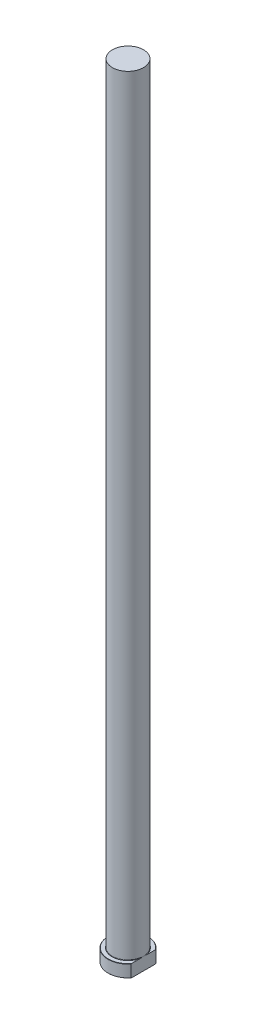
ISO-10303-21;
HEADER;
FILE_DESCRIPTION(('STEP AP214'),'2;1');
FILE_NAME('part.step','',(''),(''),'','','');
FILE_SCHEMA(('AUTOMOTIVE_DESIGN { 1 0 10303 214 1 1 1 1 }'));
ENDSEC;
DATA;
#1=APPLICATION_CONTEXT('core data for automotive mechanical design processes');
#2=APPLICATION_PROTOCOL_DEFINITION('international standard','automotive_design',2000,#1);
#3=PRODUCT_CONTEXT('',#1,'mechanical');
#4=PRODUCT('Part','Part','',(#3));
#5=PRODUCT_RELATED_PRODUCT_CATEGORY('part','',(#4));
#6=PRODUCT_DEFINITION_FORMATION('','',#4);
#7=PRODUCT_DEFINITION_CONTEXT('part definition',#1,'design');
#8=PRODUCT_DEFINITION('design','',#6,#7);
#9=PRODUCT_DEFINITION_SHAPE('','',#8);
#10=(LENGTH_UNIT() NAMED_UNIT(*) SI_UNIT(.MILLI.,.METRE.));
#11=(NAMED_UNIT(*) PLANE_ANGLE_UNIT() SI_UNIT($,.RADIAN.));
#12=(NAMED_UNIT(*) SI_UNIT($,.STERADIAN.) SOLID_ANGLE_UNIT());
#13=UNCERTAINTY_MEASURE_WITH_UNIT(LENGTH_MEASURE(1.E-05),#10,'distance_accuracy_value','');
#14=(GEOMETRIC_REPRESENTATION_CONTEXT(3) GLOBAL_UNCERTAINTY_ASSIGNED_CONTEXT((#13)) GLOBAL_UNIT_ASSIGNED_CONTEXT((#10,
#11,#12)) REPRESENTATION_CONTEXT('',''));
#15=CARTESIAN_POINT('',(0.,0.,0.));
#16=DIRECTION('',(0.,0.,1.));
#17=DIRECTION('',(1.,0.,0.));
#18=AXIS2_PLACEMENT_3D('',#15,#16,#17);
#19=CARTESIAN_POINT('',(0.,0.,0.));
#20=DIRECTION('',(0.,-1.,0.));
#21=DIRECTION('',(0.,0.,-1.));
#22=AXIS2_PLACEMENT_3D('',#19,#20,#21);
#23=PLANE('',#22);
#24=CARTESIAN_POINT('',(0.,0.,0.));
#25=DIRECTION('',(0.,-1.,0.));
#26=DIRECTION('',(0.,0.,-1.));
#27=AXIS2_PLACEMENT_3D('',#24,#25,#26);
#28=CIRCLE('',#27,15.8);
#29=CARTESIAN_POINT('',(12.5,0.,9.66385016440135));
#30=VERTEX_POINT('',#29);
#31=CARTESIAN_POINT('',(12.5,0.,-9.66385016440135));
#32=VERTEX_POINT('',#31);
#33=EDGE_CURVE('E98',#30,#32,#28,.T.);
#34=ORIENTED_EDGE('',*,*,#33,.T.);
#35=DIRECTION('',(0.,0.,1.));
#36=VECTOR('',#35,1.);
#37=CARTESIAN_POINT('',(12.5,0.,-9.98749217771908));
#38=LINE('',#37,#36);
#39=EDGE_CURVE('E83',#32,#30,#38,.T.);
#40=ORIENTED_EDGE('',*,*,#39,.T.);
#41=EDGE_LOOP('',(#34,#40));
#42=FACE_BOUND('',#41,.T.);
#43=ADVANCED_FACE('F32',(#42),#23,.T.);
#44=CARTESIAN_POINT('',(0.,259.958771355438,0.));
#45=DIRECTION('',(0.,1.,0.));
#46=DIRECTION('',(0.,0.,1.));
#47=AXIS2_PLACEMENT_3D('',#44,#45,#46);
#48=CYLINDRICAL_SURFACE('',#47,16.);
#49=CARTESIAN_POINT('',(0.,9.80000000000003,0.));
#50=DIRECTION('',(0.,1.,0.));
#51=DIRECTION('',(0.,0.,1.));
#52=AXIS2_PLACEMENT_3D('',#49,#50,#51);
#53=CIRCLE('',#52,16.);
#54=CARTESIAN_POINT('',(12.5,9.80000000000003,9.98749217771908));
#55=VERTEX_POINT('',#54);
#56=CARTESIAN_POINT('',(12.5,9.80000000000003,-9.98749217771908));
#57=VERTEX_POINT('',#56);
#58=EDGE_CURVE('E104',#55,#57,#53,.F.);
#59=ORIENTED_EDGE('',*,*,#58,.T.);
#60=DIRECTION('',(0.,-1.,0.));
#61=VECTOR('',#60,1.);
#62=CARTESIAN_POINT('',(12.5,630.,-9.98749217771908));
#63=LINE('',#62,#61);
#64=CARTESIAN_POINT('',(12.5,0.199999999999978,-9.98749217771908));
#65=VERTEX_POINT('',#64);
#66=EDGE_CURVE('E183',#57,#65,#63,.T.);
#67=ORIENTED_EDGE('',*,*,#66,.T.);
#68=CARTESIAN_POINT('',(0.,0.199999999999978,0.));
#69=DIRECTION('',(0.,-1.,0.));
#70=DIRECTION('',(0.,0.,-1.));
#71=AXIS2_PLACEMENT_3D('',#68,#69,#70);
#72=CIRCLE('',#71,16.);
#73=CARTESIAN_POINT('',(12.5,0.199999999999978,9.98749217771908));
#74=VERTEX_POINT('',#73);
#75=EDGE_CURVE('E100',#65,#74,#72,.F.);
#76=ORIENTED_EDGE('',*,*,#75,.T.);
#77=DIRECTION('',(0.,-1.,0.));
#78=VECTOR('',#77,1.);
#79=CARTESIAN_POINT('',(12.5,630.,9.98749217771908));
#80=LINE('',#79,#78);
#81=EDGE_CURVE('E93',#55,#74,#80,.T.);
#82=ORIENTED_EDGE('',*,*,#81,.F.);
#83=EDGE_LOOP('',(#59,#67,#76,#82));
#84=FACE_BOUND('',#83,.T.);
#85=ADVANCED_FACE('F158',(#84),#48,.T.);
#86=CARTESIAN_POINT('',(-16.,10.,0.));
#87=DIRECTION('',(0.,1.,0.));
#88=DIRECTION('',(0.,0.,1.));
#89=AXIS2_PLACEMENT_3D('',#86,#87,#88);
#90=PLANE('',#89);
#91=CARTESIAN_POINT('',(0.,10.,0.));
#92=DIRECTION('',(0.,1.,0.));
#93=DIRECTION('',(0.,0.,1.));
#94=AXIS2_PLACEMENT_3D('',#91,#92,#93);
#95=CIRCLE('',#94,15.8);
#96=CARTESIAN_POINT('',(12.5,10.,-9.66385016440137));
#97=VERTEX_POINT('',#96);
#98=CARTESIAN_POINT('',(12.5,10.,9.66385016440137));
#99=VERTEX_POINT('',#98);
#100=EDGE_CURVE('E178',#97,#99,#95,.T.);
#101=ORIENTED_EDGE('',*,*,#100,.T.);
#102=DIRECTION('',(0.,0.,-1.));
#103=VECTOR('',#102,1.);
#104=CARTESIAN_POINT('',(12.5,10.,0.));
#105=LINE('',#104,#103);
#106=CARTESIAN_POINT('',(12.5,10.,2.75499546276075));
#107=VERTEX_POINT('',#106);
#108=EDGE_CURVE('E57',#99,#107,#105,.T.);
#109=ORIENTED_EDGE('',*,*,#108,.T.);
#110=CARTESIAN_POINT('',(0.,10.,0.));
#111=DIRECTION('',(0.,1.,0.));
#112=DIRECTION('',(0.,0.,1.));
#113=AXIS2_PLACEMENT_3D('',#110,#111,#112);
#114=CIRCLE('',#113,12.8);
#115=CARTESIAN_POINT('',(12.5,10.,-2.75499546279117));
#116=VERTEX_POINT('',#115);
#117=EDGE_CURVE('E107',#107,#116,#114,.F.);
#118=ORIENTED_EDGE('',*,*,#117,.T.);
#119=EDGE_CURVE('E136',#116,#97,#105,.T.);
#120=ORIENTED_EDGE('',*,*,#119,.T.);
#121=EDGE_LOOP('',(#101,#109,#118,#120));
#122=FACE_BOUND('',#121,.T.);
#123=ADVANCED_FACE('F147',(#122),#90,.T.);
#124=CARTESIAN_POINT('',(0.,10.,0.));
#125=DIRECTION('',(0.,-1.,0.));
#126=DIRECTION('',(0.,0.,-1.));
#127=AXIS2_PLACEMENT_3D('',#124,#125,#126);
#128=CONICAL_SURFACE('',#127,15.8,0.785398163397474);
#129=ORIENTED_EDGE('',*,*,#58,.F.);
#130=CARTESIAN_POINT('',(12.5,0.520063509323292,21.9732835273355));
#131=CARTESIAN_POINT('',(12.5,0.802025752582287,21.6488770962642));
#132=CARTESIAN_POINT('',(12.5,1.08313217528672,21.3237240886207));
#133=CARTESIAN_POINT('',(12.5,1.64338244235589,20.6717229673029));
#134=CARTESIAN_POINT('',(12.5,1.92252625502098,20.3448748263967));
#135=CARTESIAN_POINT('',(12.5,2.47872061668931,19.689139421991));
#136=CARTESIAN_POINT('',(12.5,2.75577013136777,19.3602512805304));
#137=CARTESIAN_POINT('',(12.5,3.30732757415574,18.7003513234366));
#138=CARTESIAN_POINT('',(12.5,3.58183551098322,18.3693395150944));
#139=CARTESIAN_POINT('',(12.5,4.13404626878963,17.6974852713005));
#140=CARTESIAN_POINT('',(12.5,4.41168315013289,17.3565885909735));
#141=CARTESIAN_POINT('',(12.5,4.96342557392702,16.6719500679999));
#142=CARTESIAN_POINT('',(12.5,5.23753113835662,16.3282082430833));
#143=CARTESIAN_POINT('',(12.5,5.78155974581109,15.6375575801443));
#144=CARTESIAN_POINT('',(12.5,6.05148375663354,15.2906495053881));
#145=CARTESIAN_POINT('',(12.5,6.58649101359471,14.5931154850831));
#146=CARTESIAN_POINT('',(12.5,6.85157426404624,14.2424895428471));
#147=CARTESIAN_POINT('',(12.5,7.37633965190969,13.5365100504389));
#148=CARTESIAN_POINT('',(12.5,7.63601439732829,13.1811509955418));
#149=CARTESIAN_POINT('',(12.5,8.14848411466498,12.4654890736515));
#150=CARTESIAN_POINT('',(12.5,8.4012790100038,12.1051861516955));
#151=CARTESIAN_POINT('',(12.5,8.89877262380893,11.3785626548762));
#152=CARTESIAN_POINT('',(12.5,9.14346420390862,11.0122371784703));
#153=CARTESIAN_POINT('',(12.5,9.62269650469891,10.272992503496));
#154=CARTESIAN_POINT('',(12.5,9.85723744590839,9.90007344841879));
#155=CARTESIAN_POINT('',(12.5,10.3121733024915,9.14938704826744));
#156=CARTESIAN_POINT('',(12.5,10.5326589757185,8.77167495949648));
#157=CARTESIAN_POINT('',(12.5,10.9584323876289,8.00766886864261));
#158=CARTESIAN_POINT('',(12.5,11.1637182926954,7.62137383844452));
#159=CARTESIAN_POINT('',(12.5,11.5550521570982,6.83979556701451));
#160=CARTESIAN_POINT('',(12.5,11.7411279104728,6.44452635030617));
#161=CARTESIAN_POINT('',(12.5,12.0896891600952,5.64379531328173));
#162=CARTESIAN_POINT('',(12.5,12.2521837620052,5.23833749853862));
#163=CARTESIAN_POINT('',(12.5,12.5515074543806,4.40750298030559));
#164=CARTESIAN_POINT('',(12.5,12.6876692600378,3.98188300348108));
#165=CARTESIAN_POINT('',(12.5,12.9230664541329,3.1203601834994));
#166=CARTESIAN_POINT('',(12.5,13.0223077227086,2.68445898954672));
#167=CARTESIAN_POINT('',(12.5,13.1386499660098,2.02637177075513));
#168=CARTESIAN_POINT('',(12.5,13.1719581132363,1.80697979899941));
#169=CARTESIAN_POINT('',(12.5,13.2273896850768,1.36679892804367));
#170=CARTESIAN_POINT('',(12.5,13.2495147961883,1.14601024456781));
#171=CARTESIAN_POINT('',(12.5,13.2821590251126,0.703578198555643));
#172=CARTESIAN_POINT('',(12.5,13.2926782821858,0.481934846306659));
#173=CARTESIAN_POINT('',(12.5,13.3019073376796,0.0383999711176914));
#174=CARTESIAN_POINT('',(12.5,13.3006171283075,-0.183491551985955));
#175=CARTESIAN_POINT('',(12.5,13.2862386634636,-0.627300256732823));
#176=CARTESIAN_POINT('',(12.5,13.2731286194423,-0.849216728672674));
#177=CARTESIAN_POINT('',(12.5,13.2353379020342,-1.29205679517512));
#178=CARTESIAN_POINT('',(12.5,13.2106571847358,-1.51298038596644));
#179=CARTESIAN_POINT('',(12.5,13.1501829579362,-1.9533130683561));
#180=CARTESIAN_POINT('',(12.5,13.1143886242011,-2.17272204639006));
#181=CARTESIAN_POINT('',(12.5,13.0323124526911,-2.60958138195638));
#182=CARTESIAN_POINT('',(12.5,12.9860290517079,-2.82703144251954));
#183=CARTESIAN_POINT('',(12.5,12.8318007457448,-3.47896053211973));
#184=CARTESIAN_POINT('',(12.5,12.7089145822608,-3.90995974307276));
#185=CARTESIAN_POINT('',(12.5,12.4301044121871,-4.76088311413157));
#186=CARTESIAN_POINT('',(12.5,12.2741797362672,-5.18080704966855));
#187=CARTESIAN_POINT('',(12.5,11.899855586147,-6.09704545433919));
#188=CARTESIAN_POINT('',(12.5,11.6752155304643,-6.59079268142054));
#189=CARTESIAN_POINT('',(12.5,11.1959254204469,-7.56361802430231));
#190=CARTESIAN_POINT('',(12.5,10.9412581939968,-8.04268754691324));
#191=CARTESIAN_POINT('',(12.5,10.408564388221,-8.98884891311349));
#192=CARTESIAN_POINT('',(12.5,10.1304909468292,-9.45591416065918));
#193=CARTESIAN_POINT('',(12.5,9.55679554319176,-10.3789360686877));
#194=CARTESIAN_POINT('',(12.5,9.26117703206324,-10.8348948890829));
#195=CARTESIAN_POINT('',(12.5,8.65460060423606,-11.7400212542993));
#196=CARTESIAN_POINT('',(12.5,8.34356847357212,-12.1891388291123));
#197=CARTESIAN_POINT('',(12.5,7.71056360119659,-13.0795913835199));
#198=CARTESIAN_POINT('',(12.5,7.38859046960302,-13.5209260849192));
#199=CARTESIAN_POINT('',(12.5,6.7362707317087,-14.3965599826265));
#200=CARTESIAN_POINT('',(12.5,6.4059341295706,-14.8308666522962));
#201=CARTESIAN_POINT('',(12.5,5.73818513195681,-15.69398428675));
#202=CARTESIAN_POINT('',(12.5,5.40077283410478,-16.1227953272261));
#203=CARTESIAN_POINT('',(12.5,4.69065889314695,-17.0127103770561));
#204=CARTESIAN_POINT('',(12.5,4.31743190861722,-17.473394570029));
#205=CARTESIAN_POINT('',(12.5,3.56536441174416,-18.3901509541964));
#206=CARTESIAN_POINT('',(12.5,3.18652389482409,-18.8462231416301));
#207=CARTESIAN_POINT('',(12.5,2.42850462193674,-19.7493414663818));
#208=CARTESIAN_POINT('',(12.5,2.04937794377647,-20.1964313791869));
#209=CARTESIAN_POINT('',(12.5,1.28737664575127,-21.0872319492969));
#210=CARTESIAN_POINT('',(12.5,0.904502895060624,-21.5309433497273));
#211=CARTESIAN_POINT('',(12.5,0.520063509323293,-21.9732835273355));
#212=B_SPLINE_CURVE_WITH_KNOTS('',3,(#130,#131,#132,#133,#134,#135,#136,#137,#138,#139,#140,
#141,#142,#143,#144,#145,#146,#147,#148,#149,#150,#151,#152,#153,#154,#155,#156,#157,#158,#159,
#160,#161,#162,#163,#164,#165,#166,#167,#168,#169,#170,#171,#172,#173,#174,#175,#176,#177,#178,
#179,#180,#181,#182,#183,#184,#185,#186,#187,#188,#189,#190,#191,#192,#193,#194,#195,#196,#197,
#198,#199,#200,#201,#202,#203,#204,#205,#206,#207,#208,#209,#210,#211),.UNSPECIFIED.,.F.,.F.,(4,
2,2,2,2,2,2,2,2,2,2,2,2,2,2,2,2,2,2,2,2,2,2,2,2,2,2,2,2,2,2,2,2,2,2,2,2,2,2,2,4),(0.,
1.28945110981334,2.57892299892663,3.86899482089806,5.15906221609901,6.47799420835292,
7.79691798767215,9.11553180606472,10.4341444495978,11.7544545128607,13.0747792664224,
14.3962377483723,15.7176675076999,17.0294519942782,18.3413944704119,19.6514113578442,
20.9609210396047,22.3001940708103,23.6392537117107,24.3047314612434,24.9701088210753,
25.6354781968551,26.3008480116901,26.9674468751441,27.6340482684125,28.3006991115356,
28.9674493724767,30.3101828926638,31.6529436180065,33.2788964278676,34.9057836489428,
36.5360093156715,38.1659153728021,39.804623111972,41.4433893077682,43.0802801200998,
44.7171483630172,46.4957886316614,48.2744303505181,50.0329971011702,51.7911651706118),.UNSPECIFIED.);
#213=EDGE_CURVE('E135',#55,#99,#212,.T.);
#214=ORIENTED_EDGE('',*,*,#213,.T.);
#215=ORIENTED_EDGE('',*,*,#100,.F.);
#216=EDGE_CURVE('E127',#97,#57,#212,.T.);
#217=ORIENTED_EDGE('',*,*,#216,.T.);
#218=EDGE_LOOP('',(#129,#214,#215,#217));
#219=FACE_BOUND('',#218,.T.);
#220=ADVANCED_FACE('F143',(#219),#128,.T.);
#221=CARTESIAN_POINT('',(0.,0.199999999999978,0.));
#222=DIRECTION('',(0.,1.,0.));
#223=DIRECTION('',(0.,0.,1.));
#224=AXIS2_PLACEMENT_3D('',#221,#222,#223);
#225=CONICAL_SURFACE('',#224,16.,0.785398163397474);
#226=ORIENTED_EDGE('',*,*,#75,.F.);
#227=CARTESIAN_POINT('',(12.5,9.47993649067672,-21.9732835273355));
#228=CARTESIAN_POINT('',(12.5,9.19797424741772,-21.6488770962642));
#229=CARTESIAN_POINT('',(12.5,8.91686782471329,-21.3237240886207));
#230=CARTESIAN_POINT('',(12.5,8.35661755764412,-20.6717229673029));
#231=CARTESIAN_POINT('',(12.5,8.07747374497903,-20.3448748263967));
#232=CARTESIAN_POINT('',(12.5,7.5212793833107,-19.689139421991));
#233=CARTESIAN_POINT('',(12.5,7.24422986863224,-19.3602512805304));
#234=CARTESIAN_POINT('',(12.5,6.69267242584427,-18.7003513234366));
#235=CARTESIAN_POINT('',(12.5,6.41816448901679,-18.3693395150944));
#236=CARTESIAN_POINT('',(12.5,5.86595373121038,-17.6974852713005));
#237=CARTESIAN_POINT('',(12.5,5.58831684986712,-17.3565885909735));
#238=CARTESIAN_POINT('',(12.5,5.03657442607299,-16.6719500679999));
#239=CARTESIAN_POINT('',(12.5,4.76246886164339,-16.3282082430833));
#240=CARTESIAN_POINT('',(12.5,4.21844025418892,-15.6375575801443));
#241=CARTESIAN_POINT('',(12.5,3.94851624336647,-15.2906495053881));
#242=CARTESIAN_POINT('',(12.5,3.4135089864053,-14.5931154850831));
#243=CARTESIAN_POINT('',(12.5,3.14842573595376,-14.2424895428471));
#244=CARTESIAN_POINT('',(12.5,2.62366034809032,-13.5365100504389));
#245=CARTESIAN_POINT('',(12.5,2.36398560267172,-13.1811509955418));
#246=CARTESIAN_POINT('',(12.5,1.85151588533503,-12.4654890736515));
#247=CARTESIAN_POINT('',(12.5,1.5987209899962,-12.1051861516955));
#248=CARTESIAN_POINT('',(12.5,1.10122737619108,-11.3785626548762));
#249=CARTESIAN_POINT('',(12.5,0.856535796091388,-11.0122371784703));
#250=CARTESIAN_POINT('',(12.5,0.377303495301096,-10.272992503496));
#251=CARTESIAN_POINT('',(12.5,0.14276255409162,-9.90007344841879));
#252=CARTESIAN_POINT('',(12.5,-0.312173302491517,-9.14938704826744));
#253=CARTESIAN_POINT('',(12.5,-0.532658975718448,-8.77167495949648));
#254=CARTESIAN_POINT('',(12.5,-0.958432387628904,-8.00766886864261));
#255=CARTESIAN_POINT('',(12.5,-1.16371829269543,-7.62137383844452));
#256=CARTESIAN_POINT('',(12.5,-1.55505215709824,-6.83979556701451));
#257=CARTESIAN_POINT('',(12.5,-1.74112791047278,-6.44452635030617));
#258=CARTESIAN_POINT('',(12.5,-2.08968916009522,-5.64379531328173));
#259=CARTESIAN_POINT('',(12.5,-2.25218376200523,-5.23833749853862));
#260=CARTESIAN_POINT('',(12.5,-2.55150745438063,-4.40750298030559));
#261=CARTESIAN_POINT('',(12.5,-2.68766926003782,-3.98188300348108));
#262=CARTESIAN_POINT('',(12.5,-2.92306645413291,-3.1203601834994));
#263=CARTESIAN_POINT('',(12.5,-3.02230772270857,-2.68445898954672));
#264=CARTESIAN_POINT('',(12.5,-3.13864996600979,-2.02637177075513));
#265=CARTESIAN_POINT('',(12.5,-3.17195811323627,-1.80697979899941));
#266=CARTESIAN_POINT('',(12.5,-3.22738968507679,-1.36679892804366));
#267=CARTESIAN_POINT('',(12.5,-3.24951479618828,-1.14601024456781));
#268=CARTESIAN_POINT('',(12.5,-3.28215902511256,-0.703578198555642));
#269=CARTESIAN_POINT('',(12.5,-3.29267828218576,-0.481934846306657));
#270=CARTESIAN_POINT('',(12.5,-3.30190733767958,-0.038399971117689));
#271=CARTESIAN_POINT('',(12.5,-3.30061712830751,0.183491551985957));
#272=CARTESIAN_POINT('',(12.5,-3.28623866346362,0.627300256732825));
#273=CARTESIAN_POINT('',(12.5,-3.27312861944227,0.849216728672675));
#274=CARTESIAN_POINT('',(12.5,-3.23533790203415,1.29205679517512));
#275=CARTESIAN_POINT('',(12.5,-3.21065718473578,1.51298038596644));
#276=CARTESIAN_POINT('',(12.5,-3.15018295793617,1.95331306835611));
#277=CARTESIAN_POINT('',(12.5,-3.1143886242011,2.17272204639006));
#278=CARTESIAN_POINT('',(12.5,-3.03231245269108,2.60958138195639));
#279=CARTESIAN_POINT('',(12.5,-2.98602905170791,2.82703144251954));
#280=CARTESIAN_POINT('',(12.5,-2.83180074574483,3.47896053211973));
#281=CARTESIAN_POINT('',(12.5,-2.70891458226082,3.90995974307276));
#282=CARTESIAN_POINT('',(12.5,-2.43010441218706,4.76088311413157));
#283=CARTESIAN_POINT('',(12.5,-2.27417973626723,5.18080704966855));
#284=CARTESIAN_POINT('',(12.5,-1.89985558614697,6.09704545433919));
#285=CARTESIAN_POINT('',(12.5,-1.67521553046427,6.59079268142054));
#286=CARTESIAN_POINT('',(12.5,-1.19592542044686,7.56361802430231));
#287=CARTESIAN_POINT('',(12.5,-0.941258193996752,8.04268754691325));
#288=CARTESIAN_POINT('',(12.5,-0.40856438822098,8.98884891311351));
#289=CARTESIAN_POINT('',(12.5,-0.130490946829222,9.45591416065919));
#290=CARTESIAN_POINT('',(12.5,0.443204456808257,10.3789360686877));
#291=CARTESIAN_POINT('',(12.5,0.738822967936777,10.8348948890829));
#292=CARTESIAN_POINT('',(12.5,1.34539939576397,11.7400212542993));
#293=CARTESIAN_POINT('',(12.5,1.6564315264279,12.1891388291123));
#294=CARTESIAN_POINT('',(12.5,2.28943639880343,13.0795913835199));
#295=CARTESIAN_POINT('',(12.5,2.61140953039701,13.5209260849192));
#296=CARTESIAN_POINT('',(12.5,3.26372926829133,14.3965599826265));
#297=CARTESIAN_POINT('',(12.5,3.59406587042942,14.8308666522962));
#298=CARTESIAN_POINT('',(12.5,4.26181486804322,15.69398428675));
#299=CARTESIAN_POINT('',(12.5,4.59922716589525,16.1227953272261));
#300=CARTESIAN_POINT('',(12.5,5.30934110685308,17.0127103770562));
#301=CARTESIAN_POINT('',(12.5,5.68256809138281,17.473394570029));
#302=CARTESIAN_POINT('',(12.5,6.43463558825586,18.3901509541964));
#303=CARTESIAN_POINT('',(12.5,6.81347610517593,18.8462231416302));
#304=CARTESIAN_POINT('',(12.5,7.57149537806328,19.7493414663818));
#305=CARTESIAN_POINT('',(12.5,7.95062205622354,20.1964313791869));
#306=CARTESIAN_POINT('',(12.5,8.71262335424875,21.0872319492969));
#307=CARTESIAN_POINT('',(12.5,9.09549710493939,21.5309433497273));
#308=CARTESIAN_POINT('',(12.5,9.47993649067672,21.9732835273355));
#309=B_SPLINE_CURVE_WITH_KNOTS('',3,(#227,#228,#229,#230,#231,#232,#233,#234,#235,#236,#237,
#238,#239,#240,#241,#242,#243,#244,#245,#246,#247,#248,#249,#250,#251,#252,#253,#254,#255,#256,
#257,#258,#259,#260,#261,#262,#263,#264,#265,#266,#267,#268,#269,#270,#271,#272,#273,#274,#275,
#276,#277,#278,#279,#280,#281,#282,#283,#284,#285,#286,#287,#288,#289,#290,#291,#292,#293,#294,
#295,#296,#297,#298,#299,#300,#301,#302,#303,#304,#305,#306,#307,#308),.UNSPECIFIED.,.F.,.F.,(4,
2,2,2,2,2,2,2,2,2,2,2,2,2,2,2,2,2,2,2,2,2,2,2,2,2,2,2,2,2,2,2,2,2,2,2,2,2,2,2,4),(0.,
1.28945110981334,2.57892299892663,3.86899482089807,5.15906221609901,6.47799420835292,
7.79691798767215,9.11553180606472,10.4341444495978,11.7544545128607,13.0747792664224,
14.3962377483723,15.7176675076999,17.0294519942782,18.3413944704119,19.6514113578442,
20.9609210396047,22.3001940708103,23.6392537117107,24.3047314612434,24.9701088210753,
25.6354781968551,26.3008480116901,26.9674468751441,27.6340482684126,28.3006991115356,
28.9674493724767,30.3101828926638,31.6529436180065,33.2788964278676,34.9057836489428,
36.5360093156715,38.1659153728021,39.8046231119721,41.4433893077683,43.0802801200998,
44.7171483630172,46.4957886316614,48.2744303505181,50.0329971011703,51.7911651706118),.UNSPECIFIED.);
#310=EDGE_CURVE('E86',#65,#32,#309,.T.);
#311=ORIENTED_EDGE('',*,*,#310,.T.);
#312=ORIENTED_EDGE('',*,*,#33,.F.);
#313=EDGE_CURVE('E89',#30,#74,#309,.T.);
#314=ORIENTED_EDGE('',*,*,#313,.T.);
#315=EDGE_LOOP('',(#226,#311,#312,#314));
#316=FACE_BOUND('',#315,.T.);
#317=ADVANCED_FACE('F97',(#316),#225,.T.);
#318=CARTESIAN_POINT('',(0.,10.3,0.));
#319=DIRECTION('',(0.,1.,0.));
#320=DIRECTION('',(0.,0.,1.));
#321=AXIS2_PLACEMENT_3D('',#318,#319,#320);
#322=TOROIDAL_SURFACE('',#321,12.8,0.3);
#323=CARTESIAN_POINT('',(12.5,10.3,0.));
#324=CARTESIAN_POINT('',(12.5,10.300000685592,-6.08820746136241E-09));
#325=CARTESIAN_POINT('',(12.5,10.300001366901,-5.08876655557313E-07));
#326=CARTESIAN_POINT('',(12.5,10.3000026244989,-1.73661802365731E-06));
#327=CARTESIAN_POINT('',(12.5,10.3000031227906,-2.48490474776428E-06));
#328=CARTESIAN_POINT('',(12.5,10.3000042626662,-4.35291163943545E-06));
#329=CARTESIAN_POINT('',(12.5,10.3000048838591,-5.50325566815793E-06));
#330=CARTESIAN_POINT('',(12.5,10.3000058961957,-7.76527023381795E-06));
#331=CARTESIAN_POINT('',(12.5,10.3000063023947,-8.87193032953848E-06));
#332=CARTESIAN_POINT('',(12.5,10.3000080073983,-1.35535117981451E-05));
#333=CARTESIAN_POINT('',(12.5,10.300009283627,-1.71478698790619E-05));
#334=CARTESIAN_POINT('',(12.5,10.3000111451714,-2.39305737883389E-05));
#335=CARTESIAN_POINT('',(12.5,10.30001180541,-2.70989461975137E-05));
#336=CARTESIAN_POINT('',(12.5,10.3000165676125,-5.05411717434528E-05));
#337=CARTESIAN_POINT('',(12.5,10.3000200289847,-7.09185071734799E-05));
#338=CARTESIAN_POINT('',(12.5,10.300032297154,-0.000151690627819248));
#339=CARTESIAN_POINT('',(12.5,10.3000383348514,-0.000212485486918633));
#340=CARTESIAN_POINT('',(12.5,10.3000659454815,-0.000448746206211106));
#341=CARTESIAN_POINT('',(12.5,10.3000952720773,-0.000623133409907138));
#342=CARTESIAN_POINT('',(12.5,10.3002039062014,-0.00128772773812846));
#343=CARTESIAN_POINT('',(12.5,10.3002776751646,-0.00177866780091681));
#344=CARTESIAN_POINT('',(12.5,10.3005641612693,-0.00366503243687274));
#345=CARTESIAN_POINT('',(12.5,10.3007823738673,-0.00505974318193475));
#346=CARTESIAN_POINT('',(12.5,10.3018133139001,-0.0116680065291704));
#347=CARTESIAN_POINT('',(12.5,10.3026180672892,-0.0168825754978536));
#348=CARTESIAN_POINT('',(12.5,10.3120514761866,-0.0779781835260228));
#349=CARTESIAN_POINT('',(12.5,10.3207244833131,-0.133853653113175));
#350=CARTESIAN_POINT('',(12.5,10.3388658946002,-0.251282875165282));
#351=CARTESIAN_POINT('',(12.5,10.3483257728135,-0.312837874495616));
#352=CARTESIAN_POINT('',(12.5,10.3639287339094,-0.415046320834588));
#353=CARTESIAN_POINT('',(12.5,10.3701065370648,-0.455694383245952));
#354=CARTESIAN_POINT('',(12.5,10.3822268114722,-0.53596333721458));
#355=CARTESIAN_POINT('',(12.5,10.3881712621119,-0.57558393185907));
#356=CARTESIAN_POINT('',(12.5,10.4217048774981,-0.800849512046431));
#357=CARTESIAN_POINT('',(12.5,10.4483430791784,-0.986638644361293));
#358=CARTESIAN_POINT('',(12.5,10.4978676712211,-1.36073085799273));
#359=CARTESIAN_POINT('',(12.5,10.5207116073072,-1.54903981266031));
#360=CARTESIAN_POINT('',(12.5,10.5510813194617,-1.84372746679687));
#361=CARTESIAN_POINT('',(12.5,10.5609338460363,-1.94986334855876));
#362=CARTESIAN_POINT('',(12.5,10.5778401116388,-2.16235517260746));
#363=CARTESIAN_POINT('',(12.5,10.5848941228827,-2.26871109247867));
#364=CARTESIAN_POINT('',(12.5,10.5953321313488,-2.48120575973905));
#365=CARTESIAN_POINT('',(12.5,10.5987299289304,-2.58734380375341));
#366=CARTESIAN_POINT('',(12.5,10.6006981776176,-2.79965289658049));
#367=CARTESIAN_POINT('',(12.5,10.5992708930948,-2.90582390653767));
#368=CARTESIAN_POINT('',(12.5,10.5920660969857,-3.06242328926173));
#369=CARTESIAN_POINT('',(12.5,10.5889531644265,-3.11297361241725));
#370=CARTESIAN_POINT('',(12.5,10.5807735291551,-3.21396863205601));
#371=CARTESIAN_POINT('',(12.5,10.5757051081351,-3.26441319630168));
#372=CARTESIAN_POINT('',(12.5,10.5631618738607,-3.36425835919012));
#373=CARTESIAN_POINT('',(12.5,10.555723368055,-3.41366343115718));
#374=CARTESIAN_POINT('',(12.5,10.5375916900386,-3.51185380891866));
#375=CARTESIAN_POINT('',(12.5,10.5269024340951,-3.56063978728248));
#376=CARTESIAN_POINT('',(12.5,10.5054348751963,-3.6391830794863));
#377=CARTESIAN_POINT('',(12.5,10.4961365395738,-3.66933696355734));
#378=CARTESIAN_POINT('',(12.5,10.474763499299,-3.72862196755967));
#379=CARTESIAN_POINT('',(12.5,10.462694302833,-3.75775498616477));
#380=CARTESIAN_POINT('',(12.5,10.4380385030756,-3.80618627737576));
#381=CARTESIAN_POINT('',(12.5,10.4265070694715,-3.8259857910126));
#382=CARTESIAN_POINT('',(12.5,10.4063926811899,-3.85382979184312));
#383=CARTESIAN_POINT('',(12.5,10.3991733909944,-3.8628437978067));
#384=CARTESIAN_POINT('',(12.5,10.3835233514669,-3.87975615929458));
#385=CARTESIAN_POINT('',(12.5,10.3750969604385,-3.88765833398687));
#386=CARTESIAN_POINT('',(12.5,10.3611065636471,-3.89824999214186));
#387=CARTESIAN_POINT('',(12.5,10.3560749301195,-3.9016366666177));
#388=CARTESIAN_POINT('',(12.5,10.3455861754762,-3.90768435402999));
#389=CARTESIAN_POINT('',(12.5,10.3401292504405,-3.91034569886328));
#390=CARTESIAN_POINT('',(12.5,10.3287657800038,-3.91474619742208));
#391=CARTESIAN_POINT('',(12.5,10.3228544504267,-3.91647335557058));
#392=CARTESIAN_POINT('',(12.5,10.3108092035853,-3.91873417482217));
#393=CARTESIAN_POINT('',(12.5,10.3046756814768,-3.91926985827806));
#394=CARTESIAN_POINT('',(12.5,10.293185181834,-3.91908606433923));
#395=CARTESIAN_POINT('',(12.5,10.2878253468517,-3.91851265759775));
#396=CARTESIAN_POINT('',(12.5,10.2772818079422,-3.91645967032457));
#397=CARTESIAN_POINT('',(12.5,10.2720982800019,-3.91497921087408));
#398=CARTESIAN_POINT('',(12.5,10.2604757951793,-3.91068184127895));
#399=CARTESIAN_POINT('',(12.5,10.2541380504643,-3.90759459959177));
#400=CARTESIAN_POINT('',(12.5,10.2420308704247,-3.90046137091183));
#401=CARTESIAN_POINT('',(12.5,10.2362627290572,-3.89641326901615));
#402=CARTESIAN_POINT('',(12.5,10.2213149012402,-3.88449159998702));
#403=CARTESIAN_POINT('',(12.5,10.2126659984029,-3.87596096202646));
#404=CARTESIAN_POINT('',(12.5,10.1966439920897,-3.85778795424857));
#405=CARTESIAN_POINT('',(12.5,10.1892747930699,-3.84814232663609));
#406=CARTESIAN_POINT('',(12.5,10.1725709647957,-3.82389784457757));
#407=CARTESIAN_POINT('',(12.5,10.1637497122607,-3.80894948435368));
#408=CARTESIAN_POINT('',(12.5,10.1475318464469,-3.77828784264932));
#409=CARTESIAN_POINT('',(12.5,10.1401383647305,-3.76257297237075));
#410=CARTESIAN_POINT('',(12.5,10.1264047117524,-3.73059893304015));
#411=CARTESIAN_POINT('',(12.5,10.1200701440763,-3.71433738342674));
#412=CARTESIAN_POINT('',(12.5,10.1082745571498,-3.68152468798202));
#413=CARTESIAN_POINT('',(12.5,10.1028126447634,-3.66497385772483));
#414=CARTESIAN_POINT('',(12.5,10.0886990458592,-3.61898372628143));
#415=CARTESIAN_POINT('',(12.5,10.0807822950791,-3.58931942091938));
#416=CARTESIAN_POINT('',(12.5,10.0665587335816,-3.52960268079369));
#417=CARTESIAN_POINT('',(12.5,10.0602528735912,-3.49955002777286));
#418=CARTESIAN_POINT('',(12.5,10.0432020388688,-3.40892020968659));
#419=CARTESIAN_POINT('',(12.5,10.0343558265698,-3.34798718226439));
#420=CARTESIAN_POINT('',(12.5,10.0201228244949,-3.22565891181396));
#421=CARTESIAN_POINT('',(12.5,10.0147414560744,-3.16426309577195));
#422=CARTESIAN_POINT('',(12.5,10.0066240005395,-3.04138251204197));
#423=CARTESIAN_POINT('',(12.5,10.0038844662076,-2.97989796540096));
#424=CARTESIAN_POINT('',(12.5,10.0005131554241,-2.8577235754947));
#425=CARTESIAN_POINT('',(12.5,9.99985290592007,-2.79703443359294));
#426=CARTESIAN_POINT('',(12.5,10.0002004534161,-2.67565900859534));
#427=CARTESIAN_POINT('',(12.5,10.0012083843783,-2.61497272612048));
#428=CARTESIAN_POINT('',(12.5,10.0063170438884,-2.43292800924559));
#429=CARTESIAN_POINT('',(12.5,10.0125034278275,-2.31162822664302));
#430=CARTESIAN_POINT('',(12.5,10.028923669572,-2.06913309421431));
#431=CARTESIAN_POINT('',(12.5,10.0391638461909,-1.94793820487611));
#432=CARTESIAN_POINT('',(12.5,10.0626694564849,-1.70583328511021));
#433=CARTESIAN_POINT('',(12.5,10.0759352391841,-1.58492328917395));
#434=CARTESIAN_POINT('',(12.5,10.1189883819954,-1.22310927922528));
#435=CARTESIAN_POINT('',(12.5,10.1520738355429,-0.982605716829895));
#436=CARTESIAN_POINT('',(12.5,10.2222679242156,-0.502161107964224));
#437=CARTESIAN_POINT('',(12.5,10.2593775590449,-0.262220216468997));
#438=CARTESIAN_POINT('',(12.5,10.2965571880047,-0.0222236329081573));
#439=CARTESIAN_POINT('',(12.5,10.2965669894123,-0.0221603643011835));
#440=CARTESIAN_POINT('',(12.5,10.2972687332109,-0.017630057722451));
#441=CARTESIAN_POINT('',(12.5,10.2979552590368,-0.0131622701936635));
#442=CARTESIAN_POINT('',(12.5,10.2989608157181,-0.00672404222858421));
#443=CARTESIAN_POINT('',(12.5,10.2992709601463,-0.00475237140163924));
#444=CARTESIAN_POINT('',(12.5,10.299665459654,-0.00214447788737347));
#445=CARTESIAN_POINT('',(12.5,10.299760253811,-0.0015097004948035));
#446=CARTESIAN_POINT('',(12.5,10.2998957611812,-0.000678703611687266));
#447=CARTESIAN_POINT('',(12.5,10.2999287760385,-0.000481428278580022));
#448=CARTESIAN_POINT('',(12.5,10.2999592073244,-0.000219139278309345));
#449=CARTESIAN_POINT('',(12.5,10.2999655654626,-0.000155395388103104));
#450=CARTESIAN_POINT('',(12.5,10.2999789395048,-7.14631131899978E-05));
#451=CARTESIAN_POINT('',(12.5,10.2999826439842,-5.07827878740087E-05));
#452=CARTESIAN_POINT('',(12.5,10.2999877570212,-2.70484026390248E-05));
#453=CARTESIAN_POINT('',(12.5,10.2999884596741,-2.3870209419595E-05));
#454=CARTESIAN_POINT('',(12.5,10.2999904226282,-1.70721258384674E-05));
#455=CARTESIAN_POINT('',(12.5,10.2999917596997,-1.34738016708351E-05));
#456=CARTESIAN_POINT('',(12.5,10.2999935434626,-8.79208554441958E-06));
#457=CARTESIAN_POINT('',(12.5,10.2999939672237,-7.68838220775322E-06));
#458=CARTESIAN_POINT('',(12.5,10.2999950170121,-5.43535458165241E-06));
#459=CARTESIAN_POINT('',(12.5,10.2999956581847,-4.29133306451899E-06));
#460=CARTESIAN_POINT('',(12.5,10.2999968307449,-2.43685216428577E-06));
#461=CARTESIAN_POINT('',(12.5,10.29999734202,-1.69517537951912E-06));
#462=CARTESIAN_POINT('',(12.5,10.2999986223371,-4.8608665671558E-07));
#463=CARTESIAN_POINT('',(12.5,10.2999993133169,6.09789656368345E-09));
#464=CARTESIAN_POINT('',(12.5,10.3,0.));
#465=B_SPLINE_CURVE_WITH_KNOTS('',3,(#323,#324,#325,#326,#327,#328,#329,#330,#331,#332,#333,
#334,#335,#336,#337,#338,#339,#340,#341,#342,#343,#344,#345,#346,#347,#348,#349,#350,#351,#352,
#353,#354,#355,#356,#357,#358,#359,#360,#361,#362,#363,#364,#365,#366,#367,#368,#369,#370,#371,
#372,#373,#374,#375,#376,#377,#378,#379,#380,#381,#382,#383,#384,#385,#386,#387,#388,#389,#390,
#391,#392,#393,#394,#395,#396,#397,#398,#399,#400,#401,#402,#403,#404,#405,#406,#407,#408,#409,
#410,#411,#412,#413,#414,#415,#416,#417,#418,#419,#420,#421,#422,#423,#424,#425,#426,#427,#428,
#429,#430,#431,#432,#433,#434,#435,#436,#437,#438,#439,#440,#441,#442,#443,#444,#445,#446,#447,
#448,#449,#450,#451,#452,#453,#454,#455,#456,#457,#458,#459,#460,#461,#462,#463,#464),
.UNSPECIFIED.,.T.,.F.,(4,2,2,2,2,2,2,2,2,2,2,2,2,2,2,2,2,2,2,2,2,2,2,2,2,2,2,2,2,2,2,2,2,2,2,2,
2,2,2,2,2,2,2,2,2,2,2,2,2,2,2,2,2,2,2,2,2,2,2,2,2,2,2,2,2,2,2,2,2,2,4),(0.,2.18904227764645E-06,
4.96900724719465E-06,8.83863216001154E-06,1.23796733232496E-05,2.37905621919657E-05,
3.34897803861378E-05,9.54946146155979E-05,0.000278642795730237,0.000808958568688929,
0.00229845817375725,0.00653331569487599,0.0223624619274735,0.191994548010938,0.378827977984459,
0.502172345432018,0.622364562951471,1.1854146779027,1.75439293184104,2.07414276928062,
2.39386149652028,2.71236916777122,3.0307273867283,3.18263838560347,3.33468317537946,
3.48450253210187,3.63414210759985,3.72872153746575,3.82311455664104,3.89154751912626,
3.92612498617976,3.96058061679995,3.97873163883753,3.9968743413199,4.01524478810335,
4.03358402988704,4.04967096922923,4.06577352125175,4.08680352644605,4.10788025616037,
4.14411883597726,4.18046611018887,4.23240896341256,4.28446448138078,4.3367872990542,
4.389056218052,4.48109408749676,4.57318615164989,4.75772997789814,4.94256185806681,
5.12715223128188,5.30920363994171,5.4912696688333,5.85553516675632,6.22037071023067,
6.58524836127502,7.31345308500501,8.04183912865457,8.04203119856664,8.05559213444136,
8.06157963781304,8.0635052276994,8.06410510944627,8.06429712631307,8.06436014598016,
8.06436990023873,8.06438138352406,8.06438493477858,8.06438881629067,8.06439160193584,
8.06439379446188),.UNSPECIFIED.);
#466=CARTESIAN_POINT('',(12.5,10.3,0.));
#467=VERTEX_POINT('',#466);
#468=EDGE_CURVE('E11',#116,#467,#465,.T.);
#469=ORIENTED_EDGE('',*,*,#468,.F.);
#470=ORIENTED_EDGE('',*,*,#117,.F.);
#471=CARTESIAN_POINT('',(12.5,10.3,0.));
#472=CARTESIAN_POINT('',(12.5,10.299999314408,6.08820735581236E-09));
#473=CARTESIAN_POINT('',(12.5,10.299998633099,5.08876655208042E-07));
#474=CARTESIAN_POINT('',(12.5,10.2999973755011,1.73661802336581E-06));
#475=CARTESIAN_POINT('',(12.5,10.2999968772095,2.48490474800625E-06));
#476=CARTESIAN_POINT('',(12.5,10.2999957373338,4.35291163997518E-06));
#477=CARTESIAN_POINT('',(12.5,10.2999951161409,5.50325566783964E-06));
#478=CARTESIAN_POINT('',(12.5,10.2999941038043,7.76527023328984E-06));
#479=CARTESIAN_POINT('',(12.5,10.2999936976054,8.87193032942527E-06));
#480=CARTESIAN_POINT('',(12.5,10.2999919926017,1.35535117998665E-05));
#481=CARTESIAN_POINT('',(12.5,10.2999907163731,1.71478698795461E-05));
#482=CARTESIAN_POINT('',(12.5,10.2999888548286,2.39305737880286E-05));
#483=CARTESIAN_POINT('',(12.5,10.29998819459,2.70989461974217E-05));
#484=CARTESIAN_POINT('',(12.5,10.2999834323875,5.05411717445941E-05));
#485=CARTESIAN_POINT('',(12.5,10.2999799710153,7.09185071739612E-05));
#486=CARTESIAN_POINT('',(12.5,10.299967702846,0.000151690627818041));
#487=CARTESIAN_POINT('',(12.5,10.2999616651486,0.000212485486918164));
#488=CARTESIAN_POINT('',(12.5,10.2999340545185,0.000448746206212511));
#489=CARTESIAN_POINT('',(12.5,10.2999047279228,0.000623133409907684));
#490=CARTESIAN_POINT('',(12.5,10.2997960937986,0.00128772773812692));
#491=CARTESIAN_POINT('',(12.5,10.2997223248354,0.00177866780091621));
#492=CARTESIAN_POINT('',(12.5,10.2994358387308,0.00366503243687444));
#493=CARTESIAN_POINT('',(12.5,10.2992176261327,0.00505974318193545));
#494=CARTESIAN_POINT('',(12.5,10.2981866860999,0.0116680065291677));
#495=CARTESIAN_POINT('',(12.5,10.2973819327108,0.0168825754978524));
#496=CARTESIAN_POINT('',(12.5,10.2879485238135,0.0779781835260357));
#497=CARTESIAN_POINT('',(12.5,10.2792755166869,0.133853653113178));
#498=CARTESIAN_POINT('',(12.5,10.2611341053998,0.251282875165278));
#499=CARTESIAN_POINT('',(12.5,10.2516742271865,0.312837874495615));
#500=CARTESIAN_POINT('',(12.5,10.2360712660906,0.415046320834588));
#501=CARTESIAN_POINT('',(12.5,10.2298934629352,0.455694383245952));
#502=CARTESIAN_POINT('',(12.5,10.2177731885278,0.53596333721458));
#503=CARTESIAN_POINT('',(12.5,10.2118287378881,0.57558393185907));
#504=CARTESIAN_POINT('',(12.5,10.1782951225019,0.800849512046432));
#505=CARTESIAN_POINT('',(12.5,10.1516569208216,0.986638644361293));
#506=CARTESIAN_POINT('',(12.5,10.1021323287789,1.36073085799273));
#507=CARTESIAN_POINT('',(12.5,10.0792883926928,1.54903981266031));
#508=CARTESIAN_POINT('',(12.5,10.0489186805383,1.84372746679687));
#509=CARTESIAN_POINT('',(12.5,10.0390661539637,1.94986334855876));
#510=CARTESIAN_POINT('',(12.5,10.0221598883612,2.16235517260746));
#511=CARTESIAN_POINT('',(12.5,10.0151058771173,2.26871109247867));
#512=CARTESIAN_POINT('',(12.5,10.0046678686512,2.48120575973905));
#513=CARTESIAN_POINT('',(12.5,10.0012700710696,2.58734380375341));
#514=CARTESIAN_POINT('',(12.5,9.99930182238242,2.79965289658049));
#515=CARTESIAN_POINT('',(12.5,10.0007291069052,2.90582390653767));
#516=CARTESIAN_POINT('',(12.5,10.0079339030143,3.06242328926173));
#517=CARTESIAN_POINT('',(12.5,10.0110468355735,3.11297361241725));
#518=CARTESIAN_POINT('',(12.5,10.0192264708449,3.21396863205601));
#519=CARTESIAN_POINT('',(12.5,10.0242948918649,3.26441319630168));
#520=CARTESIAN_POINT('',(12.5,10.0368381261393,3.36425835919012));
#521=CARTESIAN_POINT('',(12.5,10.044276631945,3.41366343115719));
#522=CARTESIAN_POINT('',(12.5,10.0624083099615,3.51185380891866));
#523=CARTESIAN_POINT('',(12.5,10.0730975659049,3.56063978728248));
#524=CARTESIAN_POINT('',(12.5,10.0945651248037,3.6391830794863));
#525=CARTESIAN_POINT('',(12.5,10.1038634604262,3.66933696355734));
#526=CARTESIAN_POINT('',(12.5,10.125236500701,3.72862196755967));
#527=CARTESIAN_POINT('',(12.5,10.137305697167,3.75775498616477));
#528=CARTESIAN_POINT('',(12.5,10.1619614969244,3.80618627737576));
#529=CARTESIAN_POINT('',(12.5,10.1734929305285,3.8259857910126));
#530=CARTESIAN_POINT('',(12.5,10.1936073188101,3.85382979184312));
#531=CARTESIAN_POINT('',(12.5,10.2008266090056,3.8628437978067));
#532=CARTESIAN_POINT('',(12.5,10.2164766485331,3.87975615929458));
#533=CARTESIAN_POINT('',(12.5,10.2249030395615,3.88765833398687));
#534=CARTESIAN_POINT('',(12.5,10.2388934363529,3.89824999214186));
#535=CARTESIAN_POINT('',(12.5,10.2439250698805,3.9016366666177));
#536=CARTESIAN_POINT('',(12.5,10.2544138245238,3.90768435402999));
#537=CARTESIAN_POINT('',(12.5,10.2598707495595,3.91034569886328));
#538=CARTESIAN_POINT('',(12.5,10.2712342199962,3.91474619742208));
#539=CARTESIAN_POINT('',(12.5,10.2771455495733,3.91647335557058));
#540=CARTESIAN_POINT('',(12.5,10.2891907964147,3.91873417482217));
#541=CARTESIAN_POINT('',(12.5,10.2953243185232,3.91926985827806));
#542=CARTESIAN_POINT('',(12.5,10.306814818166,3.91908606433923));
#543=CARTESIAN_POINT('',(12.5,10.3121746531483,3.91851265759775));
#544=CARTESIAN_POINT('',(12.5,10.3227181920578,3.91645967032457));
#545=CARTESIAN_POINT('',(12.5,10.3279017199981,3.91497921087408));
#546=CARTESIAN_POINT('',(12.5,10.3395242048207,3.91068184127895));
#547=CARTESIAN_POINT('',(12.5,10.3458619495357,3.90759459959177));
#548=CARTESIAN_POINT('',(12.5,10.3579691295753,3.90046137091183));
#549=CARTESIAN_POINT('',(12.5,10.3637372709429,3.89641326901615));
#550=CARTESIAN_POINT('',(12.5,10.3786850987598,3.88449159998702));
#551=CARTESIAN_POINT('',(12.5,10.3873340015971,3.87596096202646));
#552=CARTESIAN_POINT('',(12.5,10.4033560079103,3.85778795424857));
#553=CARTESIAN_POINT('',(12.5,10.4107252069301,3.84814232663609));
#554=CARTESIAN_POINT('',(12.5,10.4274290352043,3.82389784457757));
#555=CARTESIAN_POINT('',(12.5,10.4362502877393,3.80894948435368));
#556=CARTESIAN_POINT('',(12.5,10.4524681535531,3.77828784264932));
#557=CARTESIAN_POINT('',(12.5,10.4598616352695,3.76257297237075));
#558=CARTESIAN_POINT('',(12.5,10.4735952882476,3.73059893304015));
#559=CARTESIAN_POINT('',(12.5,10.4799298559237,3.71433738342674));
#560=CARTESIAN_POINT('',(12.5,10.4917254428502,3.68152468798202));
#561=CARTESIAN_POINT('',(12.5,10.4971873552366,3.66497385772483));
#562=CARTESIAN_POINT('',(12.5,10.5113009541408,3.61898372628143));
#563=CARTESIAN_POINT('',(12.5,10.5192177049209,3.58931942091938));
#564=CARTESIAN_POINT('',(12.5,10.5334412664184,3.52960268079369));
#565=CARTESIAN_POINT('',(12.5,10.5397471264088,3.49955002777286));
#566=CARTESIAN_POINT('',(12.5,10.5567979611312,3.40892020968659));
#567=CARTESIAN_POINT('',(12.5,10.5656441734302,3.34798718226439));
#568=CARTESIAN_POINT('',(12.5,10.5798771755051,3.22565891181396));
#569=CARTESIAN_POINT('',(12.5,10.5852585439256,3.16426309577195));
#570=CARTESIAN_POINT('',(12.5,10.5933759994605,3.04138251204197));
#571=CARTESIAN_POINT('',(12.5,10.5961155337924,2.97989796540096));
#572=CARTESIAN_POINT('',(12.5,10.5994868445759,2.8577235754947));
#573=CARTESIAN_POINT('',(12.5,10.6001470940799,2.79703443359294));
#574=CARTESIAN_POINT('',(12.5,10.5997995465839,2.67565900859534));
#575=CARTESIAN_POINT('',(12.5,10.5987916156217,2.61497272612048));
#576=CARTESIAN_POINT('',(12.5,10.5936829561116,2.43292800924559));
#577=CARTESIAN_POINT('',(12.5,10.5874965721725,2.31162822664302));
#578=CARTESIAN_POINT('',(12.5,10.571076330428,2.06913309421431));
#579=CARTESIAN_POINT('',(12.5,10.5608361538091,1.94793820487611));
#580=CARTESIAN_POINT('',(12.5,10.5373305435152,1.70583328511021));
#581=CARTESIAN_POINT('',(12.5,10.5240647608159,1.58492328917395));
#582=CARTESIAN_POINT('',(12.5,10.4810116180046,1.22310927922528));
#583=CARTESIAN_POINT('',(12.5,10.4479261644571,0.982605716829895));
#584=CARTESIAN_POINT('',(12.5,10.3777320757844,0.502161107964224));
#585=CARTESIAN_POINT('',(12.5,10.3406224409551,0.262220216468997));
#586=CARTESIAN_POINT('',(12.5,10.3034428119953,0.0222236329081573));
#587=CARTESIAN_POINT('',(12.5,10.3034330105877,0.0221603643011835));
#588=CARTESIAN_POINT('',(12.5,10.3027312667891,0.017630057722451));
#589=CARTESIAN_POINT('',(12.5,10.3020447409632,0.0131622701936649));
#590=CARTESIAN_POINT('',(12.5,10.3010391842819,0.00672404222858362));
#591=CARTESIAN_POINT('',(12.5,10.3007290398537,0.00475237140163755));
#592=CARTESIAN_POINT('',(12.5,10.300334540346,0.00214447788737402));
#593=CARTESIAN_POINT('',(12.5,10.300239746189,0.00150970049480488));
#594=CARTESIAN_POINT('',(12.5,10.3001042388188,0.000678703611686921));
#595=CARTESIAN_POINT('',(12.5,10.3000712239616,0.000481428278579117));
#596=CARTESIAN_POINT('',(12.5,10.3000407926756,0.000219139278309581));
#597=CARTESIAN_POINT('',(12.5,10.3000344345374,0.000155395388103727));
#598=CARTESIAN_POINT('',(12.5,10.3000210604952,7.1463113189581E-05));
#599=CARTESIAN_POINT('',(12.5,10.3000173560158,5.07827878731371E-05));
#600=CARTESIAN_POINT('',(12.5,10.3000122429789,2.70484026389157E-05));
#601=CARTESIAN_POINT('',(12.5,10.300011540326,2.38702094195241E-05));
#602=CARTESIAN_POINT('',(12.5,10.3000095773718,1.70721258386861E-05));
#603=CARTESIAN_POINT('',(12.5,10.3000082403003,1.3473801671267E-05));
#604=CARTESIAN_POINT('',(12.5,10.3000064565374,8.79208554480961E-06));
#605=CARTESIAN_POINT('',(12.5,10.3000060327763,7.68838220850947E-06));
#606=CARTESIAN_POINT('',(12.5,10.3000049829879,5.43535458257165E-06));
#607=CARTESIAN_POINT('',(12.5,10.3000043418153,4.29133306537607E-06));
#608=CARTESIAN_POINT('',(12.5,10.3000031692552,2.43685216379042E-06));
#609=CARTESIAN_POINT('',(12.5,10.30000265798,1.69517537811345E-06));
#610=CARTESIAN_POINT('',(12.5,10.3000013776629,4.86086655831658E-07));
#611=CARTESIAN_POINT('',(12.5,10.3000006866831,-6.09789645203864E-09));
#612=CARTESIAN_POINT('',(12.5,10.3,0.));
#613=B_SPLINE_CURVE_WITH_KNOTS('',3,(#471,#472,#473,#474,#475,#476,#477,#478,#479,#480,#481,
#482,#483,#484,#485,#486,#487,#488,#489,#490,#491,#492,#493,#494,#495,#496,#497,#498,#499,#500,
#501,#502,#503,#504,#505,#506,#507,#508,#509,#510,#511,#512,#513,#514,#515,#516,#517,#518,#519,
#520,#521,#522,#523,#524,#525,#526,#527,#528,#529,#530,#531,#532,#533,#534,#535,#536,#537,#538,
#539,#540,#541,#542,#543,#544,#545,#546,#547,#548,#549,#550,#551,#552,#553,#554,#555,#556,#557,
#558,#559,#560,#561,#562,#563,#564,#565,#566,#567,#568,#569,#570,#571,#572,#573,#574,#575,#576,
#577,#578,#579,#580,#581,#582,#583,#584,#585,#586,#587,#588,#589,#590,#591,#592,#593,#594,#595,
#596,#597,#598,#599,#600,#601,#602,#603,#604,#605,#606,#607,#608,#609,#610,#611,#612),
.UNSPECIFIED.,.T.,.F.,(4,2,2,2,2,2,2,2,2,2,2,2,2,2,2,2,2,2,2,2,2,2,2,2,2,2,2,2,2,2,2,2,2,2,2,2,
2,2,2,2,2,2,2,2,2,2,2,2,2,2,2,2,2,2,2,2,2,2,2,2,2,2,2,2,2,2,2,2,2,2,4),(0.,2.18904227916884E-06,
4.96900724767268E-06,8.83863216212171E-06,1.23796733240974E-05,2.37905621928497E-05,
3.34897803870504E-05,9.54946146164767E-05,0.000278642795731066,0.000808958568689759,
0.00229845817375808,0.00653331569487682,0.0223624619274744,0.191994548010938,0.37882797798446,
0.502172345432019,0.622364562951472,1.1854146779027,1.75439293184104,2.07414276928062,
2.39386149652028,2.71236916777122,3.0307273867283,3.18263838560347,3.33468317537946,
3.48450253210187,3.63414210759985,3.72872153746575,3.82311455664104,3.89154751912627,
3.92612498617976,3.96058061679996,3.97873163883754,3.9968743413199,4.01524478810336,
4.03358402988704,4.04967096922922,4.06577352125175,4.08680352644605,4.10788025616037,
4.14411883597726,4.18046611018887,4.23240896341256,4.28446448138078,4.3367872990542,
4.389056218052,4.48109408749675,4.57318615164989,4.75772997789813,4.9425618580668,
5.12715223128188,5.30920363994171,5.4912696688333,5.85553516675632,6.22037071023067,
6.58524836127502,7.31345308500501,8.04183912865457,8.04203119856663,8.05559213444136,
8.06157963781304,8.06350522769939,8.06410510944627,8.06429712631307,8.06436014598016,
8.06436990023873,8.06438138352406,8.06438493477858,8.06438881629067,8.06439160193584,
8.06439379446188),.UNSPECIFIED.);
#614=EDGE_CURVE('E46',#467,#107,#613,.T.);
#615=ORIENTED_EDGE('',*,*,#614,.F.);
#616=CARTESIAN_POINT('',(0.,10.3,0.));
#617=DIRECTION('',(0.,1.,0.));
#618=DIRECTION('',(0.,0.,1.));
#619=AXIS2_PLACEMENT_3D('',#616,#617,#618);
#620=CIRCLE('',#619,12.5);
#621=EDGE_CURVE('E103',#467,#467,#620,.T.);
#622=ORIENTED_EDGE('',*,*,#621,.F.);
#623=EDGE_LOOP('',(#469,#470,#615,#622));
#624=FACE_BOUND('',#623,.T.);
#625=ADVANCED_FACE('F34',(#624),#322,.F.);
#626=CARTESIAN_POINT('',(0.,259.958771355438,0.));
#627=DIRECTION('',(0.,1.,0.));
#628=DIRECTION('',(0.,0.,1.));
#629=AXIS2_PLACEMENT_3D('',#626,#627,#628);
#630=CYLINDRICAL_SURFACE('',#629,12.5);
#631=ORIENTED_EDGE('',*,*,#621,.T.);
#632=EDGE_LOOP('',(#631));
#633=FACE_BOUND('',#632,.T.);
#634=CARTESIAN_POINT('',(0.,630.,0.));
#635=DIRECTION('',(0.,1.,0.));
#636=DIRECTION('',(0.,0.,1.));
#637=AXIS2_PLACEMENT_3D('',#634,#635,#636);
#638=CIRCLE('',#637,12.5);
#639=CARTESIAN_POINT('',(0.,630.,12.5));
#640=VERTEX_POINT('',#639);
#641=EDGE_CURVE('E101',#640,#640,#638,.T.);
#642=ORIENTED_EDGE('',*,*,#641,.F.);
#643=EDGE_LOOP('',(#642));
#644=FACE_BOUND('',#643,.T.);
#645=ADVANCED_FACE('F155',(#633,#644),#630,.T.);
#646=CARTESIAN_POINT('',(-12.5,630.,0.));
#647=DIRECTION('',(0.,1.,0.));
#648=DIRECTION('',(0.,0.,1.));
#649=AXIS2_PLACEMENT_3D('',#646,#647,#648);
#650=PLANE('',#649);
#651=ORIENTED_EDGE('',*,*,#641,.T.);
#652=EDGE_LOOP('',(#651));
#653=FACE_BOUND('',#652,.T.);
#654=ADVANCED_FACE('F121',(#653),#650,.T.);
#655=CARTESIAN_POINT('',(12.5,630.,-9.98749217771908));
#656=DIRECTION('',(1.,0.,0.));
#657=DIRECTION('',(0.,0.,-1.));
#658=AXIS2_PLACEMENT_3D('',#655,#656,#657);
#659=PLANE('',#658);
#660=ORIENTED_EDGE('',*,*,#66,.F.);
#661=ORIENTED_EDGE('',*,*,#216,.F.);
#662=ORIENTED_EDGE('',*,*,#119,.F.);
#663=ORIENTED_EDGE('',*,*,#468,.T.);
#664=ORIENTED_EDGE('',*,*,#614,.T.);
#665=ORIENTED_EDGE('',*,*,#108,.F.);
#666=ORIENTED_EDGE('',*,*,#213,.F.);
#667=ORIENTED_EDGE('',*,*,#81,.T.);
#668=ORIENTED_EDGE('',*,*,#313,.F.);
#669=ORIENTED_EDGE('',*,*,#39,.F.);
#670=ORIENTED_EDGE('',*,*,#310,.F.);
#671=EDGE_LOOP('',(#660,#661,#662,#663,#664,#665,#666,#667,#668,#669,#670));
#672=FACE_BOUND('',#671,.T.);
#673=ADVANCED_FACE('F85',(#672),#659,.T.);
#674=CLOSED_SHELL('',(#43,#85,#123,#220,#317,#625,#645,#654,#673));
#675=MANIFOLD_SOLID_BREP('B2',#674);
#676=ADVANCED_BREP_SHAPE_REPRESENTATION('',(#18,#675),#14);
#677=SHAPE_DEFINITION_REPRESENTATION(#9,#676);
ENDSEC;
END-ISO-10303-21;
